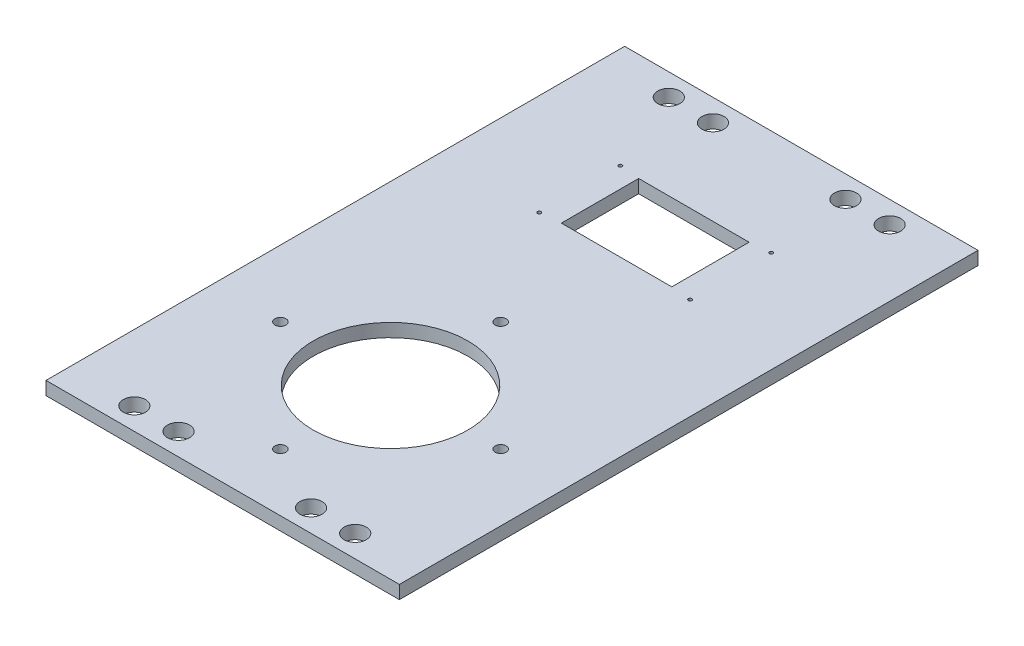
from build123d import *

# Parameters (mm, degrees)
SKETCH1_W           = 160
SKETCH1_H           = 262
BOSS_EXTRUDE1_DEPTH = 6
SKETCH3_R           = 5
CUT_EXTRUDE2_DEPTH  = 10
SKETCH6_R           = 35
CUT_EXTRUDE3_DEPTH  = 6
SKETCH7_R           = 2.5
CUT_EXTRUDE4_DEPTH  = 6
SKETCH8_R           = 0.8
SKETCH8_W           = 50
SKETCH8_H           = 35
CUT_EXTRUDE5_DEPTH  = 10


with BuildPart() as part:
    # Sketch1 → Boss-Extrude1 (new body)
    with BuildSketch(Plane(origin=(0, 0, 0), x_dir=(1, 0, 0), z_dir=(0, 1, 0))):
        Rectangle(SKETCH1_W, SKETCH1_H)
    extrude(amount=BOSS_EXTRUDE1_DEPTH)

    # Sketch3 → Cut-Extrude2 (cut)
    with BuildSketch(Plane.XZ):
        with Locations(Location((-50, 121, 0), (0, 0, 270))):
            Circle(SKETCH3_R)
        with Locations(Location((-30, 121, 0), (0, 0, 270))):
            Circle(SKETCH3_R)
        with Locations(Location((30, 121, 0), (0, 0, 270))):
            Circle(SKETCH3_R)
        with Locations(Location((50, 121, 0), (0, 0, 270))):
            Circle(SKETCH3_R)
    cut_extrude2 = extrude(amount=-CUT_EXTRUDE2_DEPTH, mode=Mode.SUBTRACT)

    # Mirror1: Cut-Extrude2 across plane
    add(cut_extrude2.mirror(Plane.XY), mode=Mode.SUBTRACT)

    # Sketch6 → Cut-Extrude3 (cut)
    with BuildSketch(Plane(origin=(0, 6, 0), x_dir=(1, 0, 0), z_dir=(0, 1, 0))):
        with Locations(Location((0, -55, 0), (0, 0, 270))):
            Circle(SKETCH6_R)
    extrude(amount=-CUT_EXTRUDE3_DEPTH, mode=Mode.SUBTRACT)

    # Sketch7 → Cut-Extrude4 (cut)
    with BuildSketch(Plane(origin=(0, 6, 0), x_dir=(1, 0, 0), z_dir=(0, 1, 0))):
        with Locations(Location((0, -104.861239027, 0), (0, 0, 270))):
            Circle(SKETCH7_R)
        with Locations(Location((-49.861239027, -55, 0), (0, 0, 270))):
            Circle(SKETCH7_R)
        with Locations(Location((49.861239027, -55, 0), (0, 0, 270))):
            Circle(SKETCH7_R)
        with Locations(Location((0, -5.138760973, 0), (0, 0, 270))):
            Circle(SKETCH7_R)
    extrude(amount=-CUT_EXTRUDE4_DEPTH, mode=Mode.SUBTRACT)

    # Sketch8 → Cut-Extrude5 (cut)
    with BuildSketch(Plane(origin=(0, 6, 0), x_dir=(1, 0, 0), z_dir=(0, 1, 0))):
        with Locations(Location((-34.16, 46.492507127, 0), (0, 0, 270))):
            Circle(SKETCH8_R)
        with Locations(Location((34.16, 46.492507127, 0), (0, 0, 270))):
            Circle(SKETCH8_R)
        with Locations(Location((-34.16, 83.212507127, 0), (0, 0, 270))):
            Circle(SKETCH8_R)
        with Locations(Location((34.16, 83.212507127, 0), (0, 0, 270))):
            Circle(SKETCH8_R)
        with Locations((0, 64.852507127)):
            Rectangle(SKETCH8_W, SKETCH8_H)
    extrude(amount=-CUT_EXTRUDE5_DEPTH, mode=Mode.SUBTRACT)


solid = part.part
